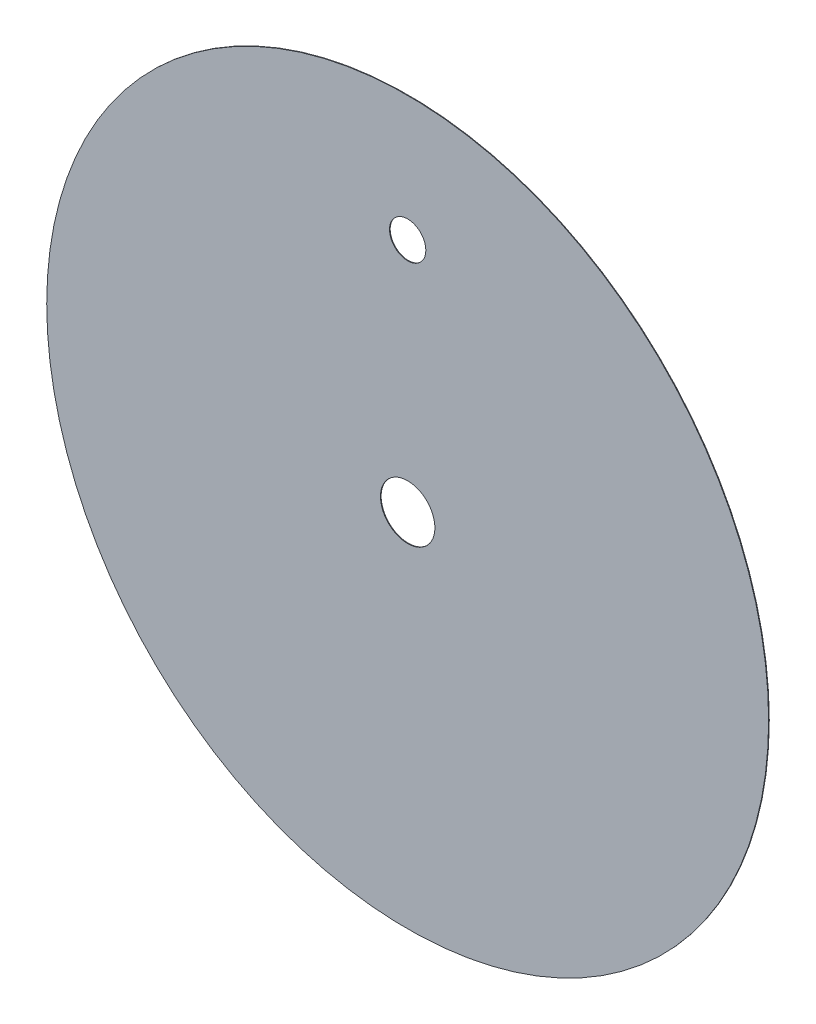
from build123d import *

# Parameters (mm, degrees)
ESQUISSE1_R      = 99.5
ESQUISSE1_R_2    = 7.5
ESQUISSE1_R_3    = 5
EXTRUSION1_DEPTH = 0.175


with BuildPart() as part:
    # Esquisse1 → Extrusion1 (new body)
    with BuildSketch(Plane.XY):
        Circle(ESQUISSE1_R)
        Circle(ESQUISSE1_R_2, mode=Mode.SUBTRACT)
        with Locations((0, 65)):
            Circle(ESQUISSE1_R_3, mode=Mode.SUBTRACT)
    extrude(amount=EXTRUSION1_DEPTH)


solid = part.part
